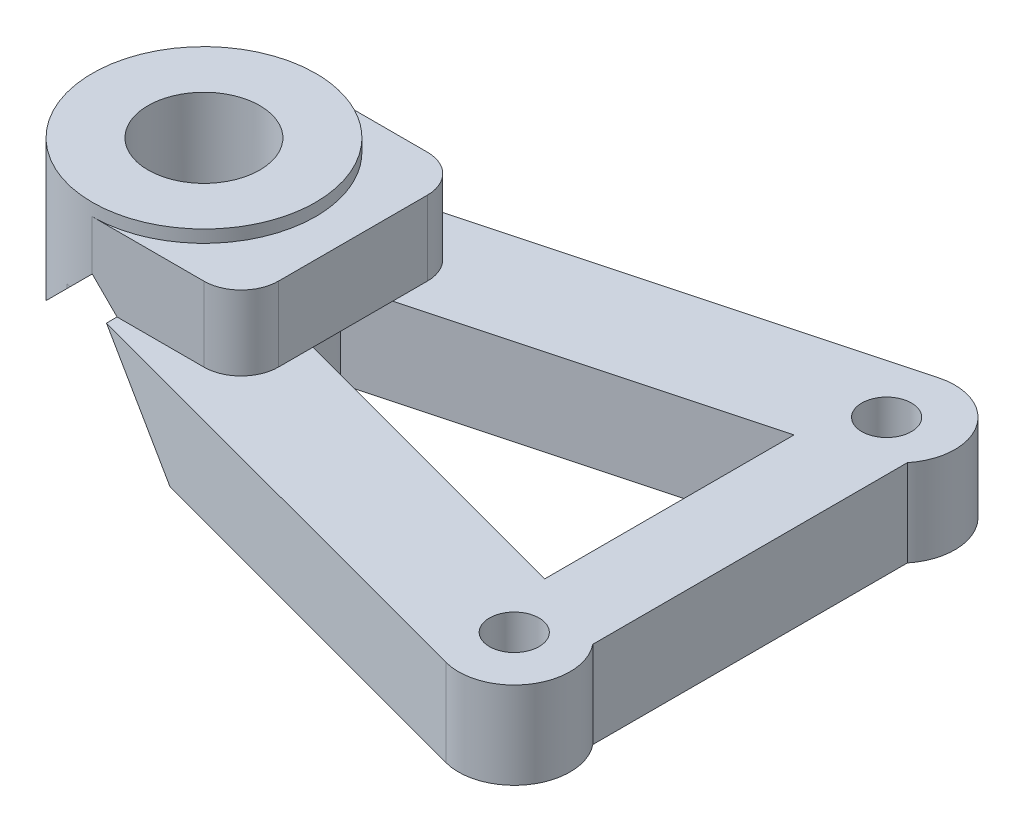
ISO-10303-21;
HEADER;
FILE_DESCRIPTION(('STEP AP214'),'2;1');
FILE_NAME('part.step','',(''),(''),'','','');
FILE_SCHEMA(('AUTOMOTIVE_DESIGN { 1 0 10303 214 1 1 1 1 }'));
ENDSEC;
DATA;
#1=APPLICATION_CONTEXT('core data for automotive mechanical design processes');
#2=APPLICATION_PROTOCOL_DEFINITION('international standard','automotive_design',2000,#1);
#3=PRODUCT_CONTEXT('',#1,'mechanical');
#4=PRODUCT('Part','Part','',(#3));
#5=PRODUCT_RELATED_PRODUCT_CATEGORY('part','',(#4));
#6=PRODUCT_DEFINITION_FORMATION('','',#4);
#7=PRODUCT_DEFINITION_CONTEXT('part definition',#1,'design');
#8=PRODUCT_DEFINITION('design','',#6,#7);
#9=PRODUCT_DEFINITION_SHAPE('','',#8);
#10=(LENGTH_UNIT() NAMED_UNIT(*) SI_UNIT(.MILLI.,.METRE.));
#11=(NAMED_UNIT(*) PLANE_ANGLE_UNIT() SI_UNIT($,.RADIAN.));
#12=(NAMED_UNIT(*) SI_UNIT($,.STERADIAN.) SOLID_ANGLE_UNIT());
#13=UNCERTAINTY_MEASURE_WITH_UNIT(LENGTH_MEASURE(1.E-05),#10,'distance_accuracy_value','');
#14=(GEOMETRIC_REPRESENTATION_CONTEXT(3) GLOBAL_UNCERTAINTY_ASSIGNED_CONTEXT((#13)) GLOBAL_UNIT_ASSIGNED_CONTEXT((#10,
#11,#12)) REPRESENTATION_CONTEXT('',''));
#15=CARTESIAN_POINT('',(0.,0.,0.));
#16=DIRECTION('',(0.,0.,1.));
#17=DIRECTION('',(1.,0.,0.));
#18=AXIS2_PLACEMENT_3D('',#15,#16,#17);
#19=CARTESIAN_POINT('',(0.,14.,0.));
#20=DIRECTION('',(0.,1.,0.));
#21=DIRECTION('',(0.,0.,1.));
#22=AXIS2_PLACEMENT_3D('',#19,#20,#21);
#23=PLANE('',#22);
#24=CARTESIAN_POINT('',(0.,14.,0.));
#25=DIRECTION('',(0.,1.,0.));
#26=DIRECTION('',(0.,0.,1.));
#27=AXIS2_PLACEMENT_3D('',#24,#25,#26);
#28=CIRCLE('',#27,4.5);
#29=CARTESIAN_POINT('',(0.,14.,-4.49999999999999));
#30=VERTEX_POINT('',#29);
#31=CARTESIAN_POINT('',(0.,14.,4.50000000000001));
#32=VERTEX_POINT('',#31);
#33=EDGE_CURVE('E215',#30,#32,#28,.F.);
#34=ORIENTED_EDGE('',*,*,#33,.T.);
#35=CARTESIAN_POINT('',(0.,14.,4.5));
#36=CARTESIAN_POINT('',(-0.858334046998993,14.,4.49989883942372));
#37=CARTESIAN_POINT('',(-1.65642619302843,14.,4.18404735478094));
#38=CARTESIAN_POINT('',(-2.08013280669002,14.,4.01636200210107));
#39=CARTESIAN_POINT('',(-2.46244389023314,14.,3.76647980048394));
#40=CARTESIAN_POINT('',(-2.85205745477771,14.,3.5118246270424));
#41=CARTESIAN_POINT('',(-3.18198051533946,14.,3.18198051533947));
#42=CARTESIAN_POINT('',(-3.5111460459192,14.,2.85289375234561));
#43=CARTESIAN_POINT('',(-3.76647980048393,14.,2.46244389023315));
#44=CARTESIAN_POINT('',(-4.01587843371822,14.,2.08106986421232));
#45=CARTESIAN_POINT('',(-4.18404735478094,14.,1.65642619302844));
#46=CARTESIAN_POINT('',(-4.49989877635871,14.,0.858869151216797));
#47=CARTESIAN_POINT('',(-4.5,14.,0.));
#48=CARTESIAN_POINT('',(-4.50010110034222,14.,-0.857822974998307));
#49=CARTESIAN_POINT('',(-4.18404735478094,14.,-1.65642619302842));
#50=CARTESIAN_POINT('',(-4.0163620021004,14.,-2.08013280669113));
#51=CARTESIAN_POINT('',(-3.76647980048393,14.,-2.46244389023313));
#52=CARTESIAN_POINT('',(-3.5118246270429,14.,-2.85205745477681));
#53=CARTESIAN_POINT('',(-3.18198051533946,14.,-3.18198051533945));
#54=CARTESIAN_POINT('',(-2.85289375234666,14.,-3.51114604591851));
#55=CARTESIAN_POINT('',(-2.46244389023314,14.,-3.76647980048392));
#56=CARTESIAN_POINT('',(-2.08106986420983,14.,-4.01587843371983));
#57=CARTESIAN_POINT('',(-1.65642619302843,14.,-4.18404735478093));
#58=CARTESIAN_POINT('',(-0.858869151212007,14.,-4.49989877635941));
#59=CARTESIAN_POINT('',(0.,14.,-4.5));
#60=B_SPLINE_CURVE_WITH_KNOTS('',2,(#35,#36,#37,#38,#39,#40,#41,#42,#43,#44,#45,#46,#47,#48,#49,
#50,#51,#52,#53,#54,#55,#56,#57,#58,#59),.UNSPECIFIED.,.F.,.F.,(3,2,2,2,2,2,2,2,2,2,2,2,3),(0.,
0.125,0.1875,0.25,0.3125,0.375,0.5,0.625,0.6875,0.75,0.8125,0.875,1.),.UNSPECIFIED.);
#61=EDGE_CURVE('E292',#32,#30,#60,.T.);
#62=ORIENTED_EDGE('',*,*,#61,.T.);
#63=EDGE_LOOP('',(#34,#62));
#64=FACE_BOUND('',#63,.T.);
#65=CARTESIAN_POINT('',(0.,14.,0.));
#66=DIRECTION('',(0.,1.,0.));
#67=DIRECTION('',(0.,0.,1.));
#68=AXIS2_PLACEMENT_3D('',#65,#66,#67);
#69=CIRCLE('',#68,9.);
#70=CARTESIAN_POINT('',(0.,14.,9.));
#71=VERTEX_POINT('',#70);
#72=CARTESIAN_POINT('',(0.,14.,-9.));
#73=VERTEX_POINT('',#72);
#74=EDGE_CURVE('E210',#71,#73,#69,.F.);
#75=ORIENTED_EDGE('',*,*,#74,.F.);
#76=CARTESIAN_POINT('',(0.,14.,9.));
#77=CARTESIAN_POINT('',(0.82572262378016,14.,8.99995134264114));
#78=CARTESIAN_POINT('',(1.6376674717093,14.,8.84974831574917));
#79=CARTESIAN_POINT('',(2.4981863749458,14.,8.69055949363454));
#80=CARTESIAN_POINT('',(3.31285238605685,14.,8.36809470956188));
#81=CARTESIAN_POINT('',(4.16073418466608,14.,8.03248230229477));
#82=CARTESIAN_POINT('',(4.92488778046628,14.,7.53295960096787));
#83=CARTESIAN_POINT('',(5.70453311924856,14.,7.02331003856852));
#84=CARTESIAN_POINT('',(6.36396103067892,14.,6.36396103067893));
#85=CARTESIAN_POINT('',(7.0226314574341,14.,5.70536941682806));
#86=CARTESIAN_POINT('',(7.53295960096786,14.,4.92488778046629));
#87=CARTESIAN_POINT('',(8.03199873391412,14.,4.16167124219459));
#88=CARTESIAN_POINT('',(8.36809470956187,14.,3.31285238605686));
#89=CARTESIAN_POINT('',(8.69026813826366,14.,2.4991952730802));
#90=CARTESIAN_POINT('',(8.84974831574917,14.,1.63766747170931));
#91=CARTESIAN_POINT('',(8.99995131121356,14.,0.826255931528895));
#92=CARTESIAN_POINT('',(9.,14.,0.));
#93=B_SPLINE_CURVE_WITH_KNOTS('',2,(#76,#77,#78,#79,#80,#81,#82,#83,#84,#85,#86,#87,#88,#89,#90,
#91,#92),.UNSPECIFIED.,.F.,.F.,(3,2,2,2,2,2,2,2,3),(0.,0.125,0.25,0.375,0.5,0.625,0.75,0.875,
1.),.UNSPECIFIED.);
#94=CARTESIAN_POINT('',(9.,14.,0.));
#95=VERTEX_POINT('',#94);
#96=EDGE_CURVE('E288',#71,#95,#93,.T.);
#97=ORIENTED_EDGE('',*,*,#96,.T.);
#98=CARTESIAN_POINT('',(9.,14.,0.));
#99=CARTESIAN_POINT('',(8.99995134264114,14.,-0.825722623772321));
#100=CARTESIAN_POINT('',(8.84974831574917,14.,-1.63766747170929));
#101=CARTESIAN_POINT('',(8.69055949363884,14.,-2.49818637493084));
#102=CARTESIAN_POINT('',(8.36809470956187,14.,-3.31285238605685));
#103=CARTESIAN_POINT('',(8.03248230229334,14.,-4.16073418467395));
#104=CARTESIAN_POINT('',(7.53295960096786,14.,-4.92488778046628));
#105=CARTESIAN_POINT('',(7.0233100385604,14.,-5.70453311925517));
#106=CARTESIAN_POINT('',(6.36396103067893,14.,-6.36396103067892));
#107=CARTESIAN_POINT('',(5.70536941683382,14.,-7.02263145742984));
#108=CARTESIAN_POINT('',(4.92488778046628,14.,-7.53295960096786));
#109=CARTESIAN_POINT('',(4.16167124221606,14.,-8.03199873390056));
#110=CARTESIAN_POINT('',(3.31285238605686,14.,-8.36809470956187));
#111=CARTESIAN_POINT('',(2.49919527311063,14.,-8.69026813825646));
#112=CARTESIAN_POINT('',(1.6376674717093,14.,-8.84974831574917));
#113=CARTESIAN_POINT('',(0.826255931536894,14.,-8.99995131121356));
#114=CARTESIAN_POINT('',(0.,14.,-9.));
#115=B_SPLINE_CURVE_WITH_KNOTS('',2,(#98,#99,#100,#101,#102,#103,#104,#105,#106,#107,#108,#109,
#110,#111,#112,#113,#114),.UNSPECIFIED.,.F.,.F.,(3,2,2,2,2,2,2,2,3),(0.,0.125,0.25,0.375,0.5,
0.625,0.75,0.875,1.),.UNSPECIFIED.);
#116=EDGE_CURVE('E289',#95,#73,#115,.T.);
#117=ORIENTED_EDGE('',*,*,#116,.T.);
#118=EDGE_LOOP('',(#75,#97,#117));
#119=FACE_BOUND('',#118,.T.);
#120=ADVANCED_FACE('F16',(#64,#119),#23,.T.);
#121=CARTESIAN_POINT('',(-2.327291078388,0.,8.693889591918));
#122=DIRECTION('',(-0.258587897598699,0.,0.965987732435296));
#123=DIRECTION('',(0.965987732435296,0.,0.258587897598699));
#124=AXIS2_PLACEMENT_3D('',#121,#122,#123);
#125=PLANE('',#124);
#126=CARTESIAN_POINT('',(-2.32729107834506,6.99999900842,8.69388959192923));
#127=CARTESIAN_POINT('',(-2.31367984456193,6.99999542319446,8.69753322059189));
#128=CARTESIAN_POINT('',(-2.30006005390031,6.99999183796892,8.70114488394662));
#129=CARTESIAN_POINT('',(-2.27280365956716,6.99998466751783,8.70830420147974));
#130=CARTESIAN_POINT('',(-2.25916705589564,6.99998108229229,8.71185185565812));
#131=CARTESIAN_POINT('',(-2.23187733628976,6.99997391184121,8.71888307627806));
#132=CARTESIAN_POINT('',(-2.21822422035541,6.99997032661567,8.72236664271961));
#133=CARTESIAN_POINT('',(-2.19090177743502,6.99996315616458,8.72926961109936));
#134=CARTESIAN_POINT('',(-2.17723245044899,6.99995957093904,8.73268901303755));
#135=CARTESIAN_POINT('',(-2.14987788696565,6.99995240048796,8.73946357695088));
#136=CARTESIAN_POINT('',(-2.13619265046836,6.99994881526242,8.742818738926));
#137=CARTESIAN_POINT('',(-2.10880656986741,6.99994164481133,8.74946474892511));
#138=CARTESIAN_POINT('',(-2.09510572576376,6.99993805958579,8.7527555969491));
#139=CARTESIAN_POINT('',(-2.06768873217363,6.99993088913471,8.7592729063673));
#140=CARTESIAN_POINT('',(-2.05397258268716,6.99992730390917,8.76249936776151));
#141=CARTESIAN_POINT('',(-2.02652528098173,6.99992013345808,8.76888783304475));
#142=CARTESIAN_POINT('',(-2.01279412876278,6.99991654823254,8.77204983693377));
#143=CARTESIAN_POINT('',(-1.99905562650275,6.999912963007,8.77517957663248));
#144=B_SPLINE_CURVE_WITH_KNOTS('',3,(#126,#127,#128,#129,#130,#131,#132,#133,#134,#135,#136,
#137,#138,#139,#140,#141,#142,#143),.UNSPECIFIED.,.F.,.F.,(4,2,2,2,2,2,2,2,4),(0.,
0.0422714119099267,0.0845428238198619,0.126814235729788,0.169085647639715,0.21135705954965,
0.253628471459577,0.295899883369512,0.338171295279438),.UNSPECIFIED.);
#145=CARTESIAN_POINT('',(-2.32729107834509,6.99999900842,8.69388959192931));
#146=VERTEX_POINT('',#145);
#147=CARTESIAN_POINT('',(-1.99982898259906,6.99994175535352,8.77811096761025));
#148=VERTEX_POINT('',#147);
#149=EDGE_CURVE('E238',#146,#148,#144,.T.);
#150=ORIENTED_EDGE('',*,*,#149,.F.);
#151=DIRECTION('',(0.,1.,0.));
#152=VECTOR('',#151,1.);
#153=CARTESIAN_POINT('',(-2.32729107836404,0.,8.69388959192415));
#154=LINE('',#153,#152);
#155=CARTESIAN_POINT('',(-2.32729107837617,6.67270892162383,8.69388959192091));
#156=VERTEX_POINT('',#155);
#157=EDGE_CURVE('E347',#156,#146,#154,.T.);
#158=ORIENTED_EDGE('',*,*,#157,.F.);
#159=DIRECTION('',(0.694769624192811,0.694769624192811,0.185984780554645));
#160=VECTOR('',#159,1.);
#161=CARTESIAN_POINT('',(-4.30519553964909,4.69480446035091,8.16441893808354));
#162=LINE('',#161,#160);
#163=EDGE_CURVE('E676',#156,#148,#162,.T.);
#164=ORIENTED_EDGE('',*,*,#163,.T.);
#165=EDGE_LOOP('',(#150,#158,#164));
#166=FACE_BOUND('',#165,.T.);
#167=ADVANCED_FACE('F308',(#166),#125,.T.);
#168=CARTESIAN_POINT('',(39.33635446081,0.,-19.84694479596));
#169=DIRECTION('',(-0.258587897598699,0.,-0.965987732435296));
#170=DIRECTION('',(-0.965987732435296,0.,0.258587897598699));
#171=AXIS2_PLACEMENT_3D('',#168,#169,#170);
#172=PLANE('',#171);
#173=DIRECTION('',(0.,1.,0.));
#174=VECTOR('',#173,1.);
#175=CARTESIAN_POINT('',(-2.32729107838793,0.,-8.69388959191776));
#176=LINE('',#175,#174);
#177=CARTESIAN_POINT('',(-2.32729107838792,6.999999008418,-8.69388959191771));
#178=VERTEX_POINT('',#177);
#179=CARTESIAN_POINT('',(-2.3272910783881,6.67270892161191,-8.69388959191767));
#180=VERTEX_POINT('',#179);
#181=EDGE_CURVE('E354',#178,#180,#176,.F.);
#182=ORIENTED_EDGE('',*,*,#181,.F.);
#183=CARTESIAN_POINT('',(-1.99905562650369,6.999912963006,-8.77517957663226));
#184=CARTESIAN_POINT('',(-2.01279412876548,6.9999165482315,-8.77204983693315));
#185=CARTESIAN_POINT('',(-2.0265252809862,6.999920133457,-8.76888783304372));
#186=CARTESIAN_POINT('',(-2.05397258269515,6.999927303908,-8.76249936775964));
#187=CARTESIAN_POINT('',(-2.06768873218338,6.9999308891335,-8.759272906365));
#188=CARTESIAN_POINT('',(-2.09510572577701,6.9999380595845,-8.75275559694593));
#189=CARTESIAN_POINT('',(-2.10880656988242,6.99994164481,-8.7494647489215));
#190=CARTESIAN_POINT('',(-2.13619265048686,6.999948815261,-8.74281873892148));
#191=CARTESIAN_POINT('',(-2.14987788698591,6.9999524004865,-8.7394635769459));
#192=CARTESIAN_POINT('',(-2.17723245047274,6.9999595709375,-8.73268901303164));
#193=CARTESIAN_POINT('',(-2.19090177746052,6.999963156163,-8.72926961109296));
#194=CARTESIAN_POINT('',(-2.2182242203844,6.999970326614,-8.72236664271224));
#195=CARTESIAN_POINT('',(-2.23187733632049,6.9999739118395,-8.7188830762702));
#196=CARTESIAN_POINT('',(-2.25916705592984,6.9999810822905,-8.71185185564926));
#197=CARTESIAN_POINT('',(-2.2728036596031,6.999984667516,-8.70830420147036));
#198=CARTESIAN_POINT('',(-2.30006005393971,6.999991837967,-8.70114488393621));
#199=CARTESIAN_POINT('',(-2.31367984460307,6.9999954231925,-8.69753322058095));
#200=CARTESIAN_POINT('',(-2.32729107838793,6.999999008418,-8.69388959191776));
#201=B_SPLINE_CURVE_WITH_KNOTS('',3,(#183,#184,#185,#186,#187,#188,#189,#190,#191,#192,#193,
#194,#195,#196,#197,#198,#199,#200),.UNSPECIFIED.,.F.,.F.,(4,2,2,2,2,2,2,2,4),(0.,
0.0422714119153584,0.0845428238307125,0.126814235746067,0.169085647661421,0.21135705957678,
0.253628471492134,0.295899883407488,0.338171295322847),.UNSPECIFIED.);
#202=CARTESIAN_POINT('',(-1.99982898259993,6.99994175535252,-8.77811096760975));
#203=VERTEX_POINT('',#202);
#204=EDGE_CURVE('E358',#203,#178,#201,.T.);
#205=ORIENTED_EDGE('',*,*,#204,.F.);
#206=DIRECTION('',(-0.694769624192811,-0.694769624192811,0.185984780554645));
#207=VECTOR('',#206,1.);
#208=CARTESIAN_POINT('',(1.89740267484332,10.8974026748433,-9.8248094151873));
#209=LINE('',#208,#207);
#210=EDGE_CURVE('E536',#203,#180,#209,.T.);
#211=ORIENTED_EDGE('',*,*,#210,.T.);
#212=EDGE_LOOP('',(#182,#205,#211));
#213=FACE_BOUND('',#212,.T.);
#214=ADVANCED_FACE('F689',(#213),#172,.T.);
#215=CARTESIAN_POINT('',(0.,13.,0.));
#216=DIRECTION('',(0.,1.,0.));
#217=DIRECTION('',(0.,0.,1.));
#218=AXIS2_PLACEMENT_3D('',#215,#216,#217);
#219=PLANE('',#218);
#220=CARTESIAN_POINT('',(8.999999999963,13.,-2.577048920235E-05));
#221=CARTESIAN_POINT('',(8.99995295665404,13.,0.877704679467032));
#222=CARTESIAN_POINT('',(8.83041086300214,13.,1.73892035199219));
#223=CARTESIAN_POINT('',(8.65761673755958,13.,2.61665523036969));
#224=CARTESIAN_POINT('',(8.31492318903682,13.,3.44413303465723));
#225=CARTESIAN_POINT('',(7.97263187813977,13.,4.27063958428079));
#226=CARTESIAN_POINT('',(7.47366731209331,13.,5.01440892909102));
#227=CARTESIAN_POINT('',(6.98495672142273,13.,5.74289343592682));
#228=CARTESIAN_POINT('',(6.36397014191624,13.,6.36395191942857));
#229=CARTESIAN_POINT('',(5.74371279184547,13.,6.98428108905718));
#230=CARTESIAN_POINT('',(5.01443032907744,13.,7.47365295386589));
#231=CARTESIAN_POINT('',(4.27159343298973,13.,7.97212027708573));
#232=CARTESIAN_POINT('',(3.4441568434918,13.,8.31491332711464));
#233=CARTESIAN_POINT('',(2.61769146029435,13.,8.65730402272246));
#234=CARTESIAN_POINT('',(1.73894563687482,13.,8.83040588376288));
#235=CARTESIAN_POINT('',(0.87825848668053,13.,8.9999504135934));
#236=CARTESIAN_POINT('',(0.,13.,9.));
#237=B_SPLINE_CURVE_WITH_KNOTS('',2,(#220,#221,#222,#223,#224,#225,#226,#227,#228,#229,#230,
#231,#232,#233,#234,#235,#236),.UNSPECIFIED.,.F.,.F.,(3,2,2,2,2,2,2,2,3),(0.,0.125,0.25,0.375,
0.5,0.625,0.75,0.875,1.),.UNSPECIFIED.);
#238=CARTESIAN_POINT('',(8.99999999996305,13.,-2.57704892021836E-05));
#239=VERTEX_POINT('',#238);
#240=CARTESIAN_POINT('',(0.,13.,9.));
#241=VERTEX_POINT('',#240);
#242=EDGE_CURVE('E343',#239,#241,#237,.T.);
#243=ORIENTED_EDGE('',*,*,#242,.T.);
#244=DIRECTION('',(1.,0.,0.));
#245=VECTOR('',#244,1.);
#246=CARTESIAN_POINT('',(0.,13.,9.));
#247=LINE('',#246,#245);
#248=CARTESIAN_POINT('',(9.,13.,9.));
#249=VERTEX_POINT('',#248);
#250=EDGE_CURVE('E223',#249,#241,#247,.F.);
#251=ORIENTED_EDGE('',*,*,#250,.F.);
#252=CARTESIAN_POINT('',(9.,13.,6.));
#253=DIRECTION('',(0.,-1.,0.));
#254=DIRECTION('',(0.,0.,-1.));
#255=AXIS2_PLACEMENT_3D('',#252,#253,#254);
#256=CIRCLE('',#255,3.);
#257=CARTESIAN_POINT('',(12.,13.,6.));
#258=VERTEX_POINT('',#257);
#259=EDGE_CURVE('E505',#258,#249,#256,.T.);
#260=ORIENTED_EDGE('',*,*,#259,.F.);
#261=DIRECTION('',(0.,0.,-1.));
#262=VECTOR('',#261,1.);
#263=CARTESIAN_POINT('',(12.,13.,9.));
#264=LINE('',#263,#262);
#265=CARTESIAN_POINT('',(12.,13.,-6.));
#266=VERTEX_POINT('',#265);
#267=EDGE_CURVE('E205',#266,#258,#264,.F.);
#268=ORIENTED_EDGE('',*,*,#267,.F.);
#269=CARTESIAN_POINT('',(9.,13.,-6.));
#270=DIRECTION('',(0.,-1.,0.));
#271=DIRECTION('',(0.,0.,-1.));
#272=AXIS2_PLACEMENT_3D('',#269,#270,#271);
#273=CIRCLE('',#272,3.);
#274=CARTESIAN_POINT('',(9.,13.,-9.));
#275=VERTEX_POINT('',#274);
#276=EDGE_CURVE('E202',#275,#266,#273,.T.);
#277=ORIENTED_EDGE('',*,*,#276,.F.);
#278=DIRECTION('',(-1.,0.,0.));
#279=VECTOR('',#278,1.);
#280=CARTESIAN_POINT('',(12.,13.,-9.));
#281=LINE('',#280,#279);
#282=CARTESIAN_POINT('',(6.97468188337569E-05,13.,-8.9999999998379));
#283=VERTEX_POINT('',#282);
#284=EDGE_CURVE('E188',#283,#275,#281,.F.);
#285=ORIENTED_EDGE('',*,*,#284,.F.);
#286=CARTESIAN_POINT('',(6.974681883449E-05,13.,-8.99999999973));
#287=CARTESIAN_POINT('',(0.825787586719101,13.,-8.99994494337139));
#288=CARTESIAN_POINT('',(1.63772672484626,13.,-8.84973735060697));
#289=CARTESIAN_POINT('',(2.4982388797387,13.,-8.6905438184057));
#290=CARTESIAN_POINT('',(3.31289777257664,13.,-8.36807674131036));
#291=CARTESIAN_POINT('',(4.16077165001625,13.,-8.03246215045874));
#292=CARTESIAN_POINT('',(4.92491776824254,13.,-7.5329399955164));
#293=CARTESIAN_POINT('',(5.70455522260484,13.,-7.02329115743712));
#294=CARTESIAN_POINT('',(6.36397657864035,13.,-6.36394548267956));
#295=CARTESIAN_POINT('',(7.02264044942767,13.,-5.70535720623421));
#296=CARTESIAN_POINT('',(7.53296405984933,13.,-4.9248809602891));
#297=CARTESIAN_POINT('',(8.03199891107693,13.,-4.16166946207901));
#298=CARTESIAN_POINT('',(8.36809292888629,13.,-3.3128568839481));
#299=CARTESIAN_POINT('',(8.69026466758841,13.,-2.49920531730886));
#300=CARTESIAN_POINT('',(8.84974535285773,13.,-1.63768348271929));
#301=CARTESIAN_POINT('',(8.99994894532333,13.,-0.826276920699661));
#302=CARTESIAN_POINT('',(8.999999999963,13.,-2.577048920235E-05));
#303=B_SPLINE_CURVE_WITH_KNOTS('',2,(#286,#287,#288,#289,#290,#291,#292,#293,#294,#295,#296,
#297,#298,#299,#300,#301,#302),.UNSPECIFIED.,.F.,.F.,(3,2,2,2,2,2,2,2,3),(0.,0.125,0.25,0.375,
0.5,0.625,0.75,0.875,1.),.UNSPECIFIED.);
#304=EDGE_CURVE('E293',#283,#239,#303,.T.);
#305=ORIENTED_EDGE('',*,*,#304,.T.);
#306=EDGE_LOOP('',(#243,#251,#260,#268,#277,#285,#305));
#307=FACE_BOUND('',#306,.T.);
#308=ADVANCED_FACE('F203',(#307),#219,.T.);
#309=CARTESIAN_POINT('',(0.,0.,0.));
#310=DIRECTION('',(0.,1.,0.));
#311=DIRECTION('',(0.,0.,1.));
#312=AXIS2_PLACEMENT_3D('',#309,#310,#311);
#313=CYLINDRICAL_SURFACE('',#312,9.);
#314=ORIENTED_EDGE('',*,*,#74,.T.);
#315=ORIENTED_EDGE('',*,*,#116,.F.);
#316=ORIENTED_EDGE('',*,*,#96,.F.);
#317=EDGE_LOOP('',(#314,#315,#316));
#318=FACE_BOUND('',#317,.T.);
#319=ORIENTED_EDGE('',*,*,#304,.F.);
#320=DIRECTION('',(1.74367047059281E-05,0.999999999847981,0.));
#321=VECTOR('',#320,1.);
#322=CARTESIAN_POINT('',(0.,9.,-9.));
#323=LINE('',#322,#321);
#324=CARTESIAN_POINT('',(0.,9.,-8.99999999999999));
#325=VERTEX_POINT('',#324);
#326=EDGE_CURVE('E196',#325,#283,#323,.T.);
#327=ORIENTED_EDGE('',*,*,#326,.F.);
#328=CARTESIAN_POINT('',(0.,9.,0.));
#329=DIRECTION('',(-0.707106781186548,0.707106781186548,0.));
#330=DIRECTION('',(0.707106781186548,0.707106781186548,0.));
#331=AXIS2_PLACEMENT_3D('',#328,#329,#330);
#332=ELLIPSE('',#331,12.7279220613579,9.);
#333=EDGE_CURVE('E665',#325,#203,#332,.T.);
#334=ORIENTED_EDGE('',*,*,#333,.T.);
#335=ORIENTED_EDGE('',*,*,#204,.T.);
#336=ORIENTED_EDGE('',*,*,#181,.T.);
#337=CARTESIAN_POINT('',(0.,9.,0.));
#338=DIRECTION('',(-0.707106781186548,0.707106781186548,0.));
#339=DIRECTION('',(0.707106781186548,0.707106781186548,0.));
#340=AXIS2_PLACEMENT_3D('',#337,#338,#339);
#341=ELLIPSE('',#340,12.7279220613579,9.);
#342=EDGE_CURVE('E218',#180,#156,#341,.T.);
#343=ORIENTED_EDGE('',*,*,#342,.T.);
#344=ORIENTED_EDGE('',*,*,#157,.T.);
#345=ORIENTED_EDGE('',*,*,#149,.T.);
#346=CARTESIAN_POINT('',(0.,9.,0.));
#347=DIRECTION('',(-0.707106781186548,0.707106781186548,0.));
#348=DIRECTION('',(0.707106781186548,0.707106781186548,0.));
#349=AXIS2_PLACEMENT_3D('',#346,#347,#348);
#350=ELLIPSE('',#349,12.7279220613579,9.);
#351=CARTESIAN_POINT('',(0.,9.,9.00000000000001));
#352=VERTEX_POINT('',#351);
#353=EDGE_CURVE('E674',#148,#352,#350,.T.);
#354=ORIENTED_EDGE('',*,*,#353,.T.);
#355=DIRECTION('',(0.,1.,0.));
#356=VECTOR('',#355,1.);
#357=CARTESIAN_POINT('',(0.,7.,9.));
#358=LINE('',#357,#356);
#359=EDGE_CURVE('E226',#241,#352,#358,.F.);
#360=ORIENTED_EDGE('',*,*,#359,.F.);
#361=ORIENTED_EDGE('',*,*,#242,.F.);
#362=EDGE_LOOP('',(#319,#327,#334,#335,#336,#343,#344,#345,#354,#360,#361));
#363=FACE_BOUND('',#362,.T.);
#364=ADVANCED_FACE('F244',(#318,#363),#313,.T.);
#365=CARTESIAN_POINT('',(9.,32.2504,-6.));
#366=DIRECTION('',(0.,-1.,0.));
#367=DIRECTION('',(0.,0.,-1.));
#368=AXIS2_PLACEMENT_3D('',#365,#366,#367);
#369=CYLINDRICAL_SURFACE('',#368,3.);
#370=DIRECTION('',(0.,1.,0.));
#371=VECTOR('',#370,1.);
#372=CARTESIAN_POINT('',(9.,7.,-9.));
#373=LINE('',#372,#371);
#374=CARTESIAN_POINT('',(9.,7.,-9.));
#375=VERTEX_POINT('',#374);
#376=EDGE_CURVE('E192',#275,#375,#373,.F.);
#377=ORIENTED_EDGE('',*,*,#376,.F.);
#378=ORIENTED_EDGE('',*,*,#276,.T.);
#379=DIRECTION('',(0.,1.,0.));
#380=VECTOR('',#379,1.);
#381=CARTESIAN_POINT('',(12.,7.,-6.));
#382=LINE('',#381,#380);
#383=CARTESIAN_POINT('',(12.,7.,-6.));
#384=VERTEX_POINT('',#383);
#385=EDGE_CURVE('E209',#384,#266,#382,.T.);
#386=ORIENTED_EDGE('',*,*,#385,.F.);
#387=CARTESIAN_POINT('',(9.,7.,-6.));
#388=DIRECTION('',(0.,-1.,0.));
#389=DIRECTION('',(0.,0.,-1.));
#390=AXIS2_PLACEMENT_3D('',#387,#388,#389);
#391=CIRCLE('',#390,3.);
#392=EDGE_CURVE('E214',#375,#384,#391,.T.);
#393=ORIENTED_EDGE('',*,*,#392,.F.);
#394=EDGE_LOOP('',(#377,#378,#386,#393));
#395=FACE_BOUND('',#394,.T.);
#396=ADVANCED_FACE('F213',(#395),#369,.T.);
#397=CARTESIAN_POINT('',(12.,7.,9.));
#398=DIRECTION('',(1.,0.,0.));
#399=DIRECTION('',(0.,0.,-1.));
#400=AXIS2_PLACEMENT_3D('',#397,#398,#399);
#401=PLANE('',#400);
#402=ORIENTED_EDGE('',*,*,#385,.T.);
#403=ORIENTED_EDGE('',*,*,#267,.T.);
#404=DIRECTION('',(0.,-1.,0.));
#405=VECTOR('',#404,1.);
#406=CARTESIAN_POINT('',(12.,32.2504,6.));
#407=LINE('',#406,#405);
#408=CARTESIAN_POINT('',(12.,7.,6.));
#409=VERTEX_POINT('',#408);
#410=EDGE_CURVE('E233',#409,#258,#407,.F.);
#411=ORIENTED_EDGE('',*,*,#410,.F.);
#412=DIRECTION('',(0.,0.,1.));
#413=VECTOR('',#412,1.);
#414=CARTESIAN_POINT('',(12.,7.,0.));
#415=LINE('',#414,#413);
#416=CARTESIAN_POINT('',(12.0000000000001,7.,3.21231281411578));
#417=VERTEX_POINT('',#416);
#418=EDGE_CURVE('E367',#417,#409,#415,.T.);
#419=ORIENTED_EDGE('',*,*,#418,.F.);
#420=DIRECTION('',(0.,0.,1.));
#421=VECTOR('',#420,1.);
#422=CARTESIAN_POINT('',(12.,7.,0.));
#423=LINE('',#422,#421);
#424=CARTESIAN_POINT('',(12.,7.,-3.21231281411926));
#425=VERTEX_POINT('',#424);
#426=EDGE_CURVE('E481',#417,#425,#423,.F.);
#427=ORIENTED_EDGE('',*,*,#426,.T.);
#428=DIRECTION('',(0.,0.,1.));
#429=VECTOR('',#428,1.);
#430=CARTESIAN_POINT('',(12.,7.,0.));
#431=LINE('',#430,#429);
#432=EDGE_CURVE('E369',#384,#425,#431,.T.);
#433=ORIENTED_EDGE('',*,*,#432,.F.);
#434=EDGE_LOOP('',(#402,#403,#411,#419,#427,#433));
#435=FACE_BOUND('',#434,.T.);
#436=ADVANCED_FACE('F733',(#435),#401,.T.);
#437=CARTESIAN_POINT('',(9.,32.2504,6.));
#438=DIRECTION('',(0.,-1.,0.));
#439=DIRECTION('',(0.,0.,-1.));
#440=AXIS2_PLACEMENT_3D('',#437,#438,#439);
#441=CYLINDRICAL_SURFACE('',#440,3.);
#442=ORIENTED_EDGE('',*,*,#410,.T.);
#443=ORIENTED_EDGE('',*,*,#259,.T.);
#444=DIRECTION('',(0.,1.,0.));
#445=VECTOR('',#444,1.);
#446=CARTESIAN_POINT('',(9.,7.,9.));
#447=LINE('',#446,#445);
#448=CARTESIAN_POINT('',(9.,7.,9.));
#449=VERTEX_POINT('',#448);
#450=EDGE_CURVE('E227',#449,#249,#447,.T.);
#451=ORIENTED_EDGE('',*,*,#450,.F.);
#452=CARTESIAN_POINT('',(9.,7.,6.));
#453=DIRECTION('',(0.,-1.,0.));
#454=DIRECTION('',(0.,0.,-1.));
#455=AXIS2_PLACEMENT_3D('',#452,#453,#454);
#456=CIRCLE('',#455,3.);
#457=EDGE_CURVE('E364',#409,#449,#456,.T.);
#458=ORIENTED_EDGE('',*,*,#457,.F.);
#459=EDGE_LOOP('',(#442,#443,#451,#458));
#460=FACE_BOUND('',#459,.T.);
#461=ADVANCED_FACE('F739',(#460),#441,.T.);
#462=CARTESIAN_POINT('',(12.,7.,-9.));
#463=DIRECTION('',(0.,0.,-1.));
#464=DIRECTION('',(-1.,0.,0.));
#465=AXIS2_PLACEMENT_3D('',#462,#463,#464);
#466=PLANE('',#465);
#467=ORIENTED_EDGE('',*,*,#376,.T.);
#468=DIRECTION('',(1.,0.,0.));
#469=VECTOR('',#468,1.);
#470=CARTESIAN_POINT('',(0.,7.,-9.));
#471=LINE('',#470,#469);
#472=CARTESIAN_POINT('',(2.,7.,-8.99999999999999));
#473=VERTEX_POINT('',#472);
#474=EDGE_CURVE('E375',#473,#375,#471,.T.);
#475=ORIENTED_EDGE('',*,*,#474,.F.);
#476=DIRECTION('',(-0.707106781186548,0.707106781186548,0.));
#477=VECTOR('',#476,1.);
#478=CARTESIAN_POINT('',(9.,0.,-8.99999999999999));
#479=LINE('',#478,#477);
#480=EDGE_CURVE('E388',#473,#325,#479,.T.);
#481=ORIENTED_EDGE('',*,*,#480,.T.);
#482=ORIENTED_EDGE('',*,*,#326,.T.);
#483=ORIENTED_EDGE('',*,*,#284,.T.);
#484=EDGE_LOOP('',(#467,#475,#481,#482,#483));
#485=FACE_BOUND('',#484,.T.);
#486=ADVANCED_FACE('F190',(#485),#466,.T.);
#487=CARTESIAN_POINT('',(0.,0.,0.));
#488=DIRECTION('',(0.,1.,0.));
#489=DIRECTION('',(0.,0.,1.));
#490=AXIS2_PLACEMENT_3D('',#487,#488,#489);
#491=CYLINDRICAL_SURFACE('',#490,4.5);
#492=ORIENTED_EDGE('',*,*,#33,.F.);
#493=ORIENTED_EDGE('',*,*,#61,.F.);
#494=EDGE_LOOP('',(#492,#493));
#495=FACE_BOUND('',#494,.T.);
#496=CARTESIAN_POINT('',(0.,9.,0.));
#497=DIRECTION('',(0.707106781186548,0.707106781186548,0.));
#498=DIRECTION('',(-0.707106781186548,0.707106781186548,0.));
#499=AXIS2_PLACEMENT_3D('',#496,#497,#498);
#500=ELLIPSE('',#499,6.36396103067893,4.5);
#501=CARTESIAN_POINT('',(0.,9.,-4.49999999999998));
#502=VERTEX_POINT('',#501);
#503=CARTESIAN_POINT('',(0.,9.,4.50000000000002));
#504=VERTEX_POINT('',#503);
#505=EDGE_CURVE('E384',#502,#504,#500,.F.);
#506=ORIENTED_EDGE('',*,*,#505,.T.);
#507=CARTESIAN_POINT('',(0.,9.,0.));
#508=DIRECTION('',(-0.707106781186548,0.707106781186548,0.));
#509=DIRECTION('',(0.707106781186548,0.707106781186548,0.));
#510=AXIS2_PLACEMENT_3D('',#507,#508,#509);
#511=ELLIPSE('',#510,6.36396103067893,4.5);
#512=EDGE_CURVE('E670',#504,#502,#511,.F.);
#513=ORIENTED_EDGE('',*,*,#512,.T.);
#514=EDGE_LOOP('',(#506,#513));
#515=FACE_BOUND('',#514,.T.);
#516=ADVANCED_FACE('F554',(#495,#515),#491,.F.);
#517=CARTESIAN_POINT('',(0.,9.,-24.00078380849));
#518=DIRECTION('',(-0.707106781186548,0.707106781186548,0.));
#519=DIRECTION('',(-0.707106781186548,-0.707106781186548,0.));
#520=AXIS2_PLACEMENT_3D('',#517,#518,#519);
#521=PLANE('',#520);
#522=ORIENTED_EDGE('',*,*,#333,.F.);
#523=DIRECTION('',(0.,0.,1.));
#524=VECTOR('',#523,1.);
#525=CARTESIAN_POINT('',(0.,9.,-24.00078380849));
#526=LINE('',#525,#524);
#527=EDGE_CURVE('E385',#325,#502,#526,.T.);
#528=ORIENTED_EDGE('',*,*,#527,.T.);
#529=ORIENTED_EDGE('',*,*,#512,.F.);
#530=DIRECTION('',(0.,0.,1.));
#531=VECTOR('',#530,1.);
#532=CARTESIAN_POINT('',(0.,9.,-24.00078380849));
#533=LINE('',#532,#531);
#534=EDGE_CURVE('E380',#504,#352,#533,.T.);
#535=ORIENTED_EDGE('',*,*,#534,.T.);
#536=ORIENTED_EDGE('',*,*,#353,.F.);
#537=ORIENTED_EDGE('',*,*,#163,.F.);
#538=ORIENTED_EDGE('',*,*,#342,.F.);
#539=ORIENTED_EDGE('',*,*,#210,.F.);
#540=EDGE_LOOP('',(#522,#528,#529,#535,#536,#537,#538,#539));
#541=FACE_BOUND('',#540,.T.);
#542=ADVANCED_FACE('F564',(#541),#521,.F.);
#543=CARTESIAN_POINT('',(0.,7.,9.));
#544=DIRECTION('',(0.,0.,1.));
#545=DIRECTION('',(1.,0.,0.));
#546=AXIS2_PLACEMENT_3D('',#543,#544,#545);
#547=PLANE('',#546);
#548=ORIENTED_EDGE('',*,*,#250,.T.);
#549=ORIENTED_EDGE('',*,*,#359,.T.);
#550=DIRECTION('',(-0.707106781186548,0.707106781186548,0.));
#551=VECTOR('',#550,1.);
#552=CARTESIAN_POINT('',(9.,0.,9.00000000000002));
#553=LINE('',#552,#551);
#554=CARTESIAN_POINT('',(2.,7.,9.00000000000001));
#555=VERTEX_POINT('',#554);
#556=EDGE_CURVE('E383',#352,#555,#553,.F.);
#557=ORIENTED_EDGE('',*,*,#556,.T.);
#558=DIRECTION('',(1.,0.,0.));
#559=VECTOR('',#558,1.);
#560=CARTESIAN_POINT('',(0.,7.,9.));
#561=LINE('',#560,#559);
#562=EDGE_CURVE('E361',#449,#555,#561,.F.);
#563=ORIENTED_EDGE('',*,*,#562,.F.);
#564=ORIENTED_EDGE('',*,*,#450,.T.);
#565=EDGE_LOOP('',(#548,#549,#557,#563,#564));
#566=FACE_BOUND('',#565,.T.);
#567=ADVANCED_FACE('F568',(#566),#547,.T.);
#568=CARTESIAN_POINT('',(0.,7.,0.));
#569=DIRECTION('',(0.,1.,0.));
#570=DIRECTION('',(0.,0.,1.));
#571=AXIS2_PLACEMENT_3D('',#568,#569,#570);
#572=PLANE('',#571);
#573=CARTESIAN_POINT('',(0.,7.,0.));
#574=DIRECTION('',(0.,1.,0.));
#575=DIRECTION('',(0.,0.,1.));
#576=AXIS2_PLACEMENT_3D('',#573,#574,#575);
#577=CIRCLE('',#576,9.);
#578=CARTESIAN_POINT('',(8.69388959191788,7.,-2.32729107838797));
#579=VERTEX_POINT('',#578);
#580=CARTESIAN_POINT('',(8.69388959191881,7.,2.32729107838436));
#581=VERTEX_POINT('',#580);
#582=EDGE_CURVE('E377',#579,#581,#577,.F.);
#583=ORIENTED_EDGE('',*,*,#582,.F.);
#584=DIRECTION('',(0.965987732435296,0.,-0.258587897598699));
#585=VECTOR('',#584,1.);
#586=CARTESIAN_POINT('',(8.693889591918,7.,-2.327291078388));
#587=LINE('',#586,#585);
#588=EDGE_CURVE('E477',#425,#579,#587,.F.);
#589=ORIENTED_EDGE('',*,*,#588,.F.);
#590=ORIENTED_EDGE('',*,*,#426,.F.);
#591=DIRECTION('',(-0.965987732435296,0.,-0.258587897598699));
#592=VECTOR('',#591,1.);
#593=CARTESIAN_POINT('',(37.5,7.,10.03847754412));
#594=LINE('',#593,#592);
#595=EDGE_CURVE('E518',#581,#417,#594,.F.);
#596=ORIENTED_EDGE('',*,*,#595,.F.);
#597=EDGE_LOOP('',(#583,#589,#590,#596));
#598=FACE_BOUND('',#597,.T.);
#599=ADVANCED_FACE('F572',(#598),#572,.F.);
#600=CARTESIAN_POINT('',(0.,0.,0.));
#601=DIRECTION('',(0.,1.,0.));
#602=DIRECTION('',(0.,0.,1.));
#603=AXIS2_PLACEMENT_3D('',#600,#601,#602);
#604=CYLINDRICAL_SURFACE('',#603,9.);
#605=ORIENTED_EDGE('',*,*,#582,.T.);
#606=DIRECTION('',(0.,1.,0.));
#607=VECTOR('',#606,1.);
#608=CARTESIAN_POINT('',(8.69388959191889,0.,2.32729107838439));
#609=LINE('',#608,#607);
#610=CARTESIAN_POINT('',(8.69388959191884,0.306110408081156,2.32729107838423));
#611=VERTEX_POINT('',#610);
#612=EDGE_CURVE('E491',#611,#581,#609,.T.);
#613=ORIENTED_EDGE('',*,*,#612,.F.);
#614=CARTESIAN_POINT('',(0.,9.,0.));
#615=DIRECTION('',(0.707106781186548,0.707106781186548,0.));
#616=DIRECTION('',(-0.707106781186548,0.707106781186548,0.));
#617=AXIS2_PLACEMENT_3D('',#614,#615,#616);
#618=ELLIPSE('',#617,12.7279220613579,9.);
#619=CARTESIAN_POINT('',(8.69388959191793,0.306110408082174,-2.32729107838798));
#620=VERTEX_POINT('',#619);
#621=EDGE_CURVE('E392',#611,#620,#618,.T.);
#622=ORIENTED_EDGE('',*,*,#621,.T.);
#623=DIRECTION('',(0.,1.,0.));
#624=VECTOR('',#623,1.);
#625=CARTESIAN_POINT('',(8.693889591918,0.,-2.327291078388));
#626=LINE('',#625,#624);
#627=EDGE_CURVE('E474',#579,#620,#626,.F.);
#628=ORIENTED_EDGE('',*,*,#627,.F.);
#629=EDGE_LOOP('',(#605,#613,#622,#628));
#630=FACE_BOUND('',#629,.T.);
#631=ADVANCED_FACE('F576',(#630),#604,.T.);
#632=CARTESIAN_POINT('',(0.,7.,0.));
#633=DIRECTION('',(0.,1.,0.));
#634=DIRECTION('',(0.,0.,1.));
#635=AXIS2_PLACEMENT_3D('',#632,#633,#634);
#636=PLANE('',#635);
#637=CARTESIAN_POINT('',(40.,7.,-15.));
#638=DIRECTION('',(0.,1.,0.));
#639=DIRECTION('',(0.,0.,1.));
#640=AXIS2_PLACEMENT_3D('',#637,#638,#639);
#641=CIRCLE('',#640,2.);
#642=CARTESIAN_POINT('',(40.,7.,-13.));
#643=VERTEX_POINT('',#642);
#644=EDGE_CURVE('E459',#643,#643,#641,.F.);
#645=ORIENTED_EDGE('',*,*,#644,.T.);
#646=EDGE_LOOP('',(#645));
#647=FACE_BOUND('',#646,.T.);
#648=CARTESIAN_POINT('',(40.,7.,15.));
#649=DIRECTION('',(0.,1.,0.));
#650=DIRECTION('',(0.,0.,1.));
#651=AXIS2_PLACEMENT_3D('',#648,#649,#650);
#652=CIRCLE('',#651,2.);
#653=CARTESIAN_POINT('',(40.,7.,17.));
#654=VERTEX_POINT('',#653);
#655=EDGE_CURVE('E476',#654,#654,#652,.F.);
#656=ORIENTED_EDGE('',*,*,#655,.T.);
#657=EDGE_LOOP('',(#656));
#658=FACE_BOUND('',#657,.T.);
#659=ORIENTED_EDGE('',*,*,#457,.T.);
#660=ORIENTED_EDGE('',*,*,#562,.T.);
#661=DIRECTION('',(0.,0.,1.));
#662=VECTOR('',#661,1.);
#663=CARTESIAN_POINT('',(2.,7.,-24.00078380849));
#664=LINE('',#663,#662);
#665=CARTESIAN_POINT('',(1.99999999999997,7.,9.85227397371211));
#666=VERTEX_POINT('',#665);
#667=EDGE_CURVE('E416',#555,#666,#664,.T.);
#668=ORIENTED_EDGE('',*,*,#667,.T.);
#669=DIRECTION('',(0.965987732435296,0.,0.258587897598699));
#670=VECTOR('',#669,1.);
#671=CARTESIAN_POINT('',(-2.327291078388,7.,8.693889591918));
#672=LINE('',#671,#670);
#673=CARTESIAN_POINT('',(39.3363544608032,7.,19.8469447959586));
#674=VERTEX_POINT('',#673);
#675=EDGE_CURVE('E438',#674,#666,#672,.F.);
#676=ORIENTED_EDGE('',*,*,#675,.F.);
#677=CARTESIAN_POINT('',(40.5,7.,15.5));
#678=DIRECTION('',(0.,1.,0.));
#679=DIRECTION('',(0.,0.,1.));
#680=AXIS2_PLACEMENT_3D('',#677,#678,#679);
#681=CIRCLE('',#680,4.5);
#682=CARTESIAN_POINT('',(44.,7.,12.6715728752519));
#683=VERTEX_POINT('',#682);
#684=EDGE_CURVE('E520',#683,#674,#681,.F.);
#685=ORIENTED_EDGE('',*,*,#684,.F.);
#686=DIRECTION('',(0.,0.,-1.));
#687=VECTOR('',#686,1.);
#688=CARTESIAN_POINT('',(44.,7.,12.67157287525));
#689=LINE('',#688,#687);
#690=CARTESIAN_POINT('',(43.9999999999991,7.,-12.6715728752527));
#691=VERTEX_POINT('',#690);
#692=EDGE_CURVE('E434',#691,#683,#689,.F.);
#693=ORIENTED_EDGE('',*,*,#692,.F.);
#694=CARTESIAN_POINT('',(40.5,7.,-15.5));
#695=DIRECTION('',(0.,1.,0.));
#696=DIRECTION('',(0.,0.,1.));
#697=AXIS2_PLACEMENT_3D('',#694,#695,#696);
#698=CIRCLE('',#697,4.5);
#699=CARTESIAN_POINT('',(39.3363544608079,7.,-19.8469447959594));
#700=VERTEX_POINT('',#699);
#701=EDGE_CURVE('E431',#700,#691,#698,.F.);
#702=ORIENTED_EDGE('',*,*,#701,.F.);
#703=DIRECTION('',(-0.965987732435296,0.,0.258587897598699));
#704=VECTOR('',#703,1.);
#705=CARTESIAN_POINT('',(39.33635446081,7.,-19.84694479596));
#706=LINE('',#705,#704);
#707=CARTESIAN_POINT('',(2.00000000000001,7.,-9.85227397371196));
#708=VERTEX_POINT('',#707);
#709=EDGE_CURVE('E417',#708,#700,#706,.F.);
#710=ORIENTED_EDGE('',*,*,#709,.F.);
#711=DIRECTION('',(0.,0.,1.));
#712=VECTOR('',#711,1.);
#713=CARTESIAN_POINT('',(2.,7.,-24.00078380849));
#714=LINE('',#713,#712);
#715=EDGE_CURVE('E426',#708,#473,#714,.T.);
#716=ORIENTED_EDGE('',*,*,#715,.T.);
#717=ORIENTED_EDGE('',*,*,#474,.T.);
#718=ORIENTED_EDGE('',*,*,#392,.T.);
#719=ORIENTED_EDGE('',*,*,#432,.T.);
#720=DIRECTION('',(0.965987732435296,0.,-0.258587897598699));
#721=VECTOR('',#720,1.);
#722=CARTESIAN_POINT('',(8.693889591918,7.,-2.327291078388));
#723=LINE('',#722,#721);
#724=CARTESIAN_POINT('',(37.4999999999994,7.,-10.0384775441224));
#725=VERTEX_POINT('',#724);
#726=EDGE_CURVE('E465',#725,#425,#723,.F.);
#727=ORIENTED_EDGE('',*,*,#726,.F.);
#728=DIRECTION('',(0.,0.,1.));
#729=VECTOR('',#728,1.);
#730=CARTESIAN_POINT('',(37.5,7.,-10.03847754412));
#731=LINE('',#730,#729);
#732=CARTESIAN_POINT('',(37.5,7.,10.03847754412));
#733=VERTEX_POINT('',#732);
#734=EDGE_CURVE('E363',#733,#725,#731,.F.);
#735=ORIENTED_EDGE('',*,*,#734,.F.);
#736=DIRECTION('',(-0.965987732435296,0.,-0.258587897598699));
#737=VECTOR('',#736,1.);
#738=CARTESIAN_POINT('',(37.5,7.,10.03847754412));
#739=LINE('',#738,#737);
#740=EDGE_CURVE('E454',#417,#733,#739,.F.);
#741=ORIENTED_EDGE('',*,*,#740,.F.);
#742=ORIENTED_EDGE('',*,*,#418,.T.);
#743=EDGE_LOOP('',(#659,#660,#668,#676,#685,#693,#702,#710,#716,#717,#718,#719,#727,#735,#741,#742));
#744=FACE_BOUND('',#743,.T.);
#745=ADVANCED_FACE('F580',(#647,#658,#744),#636,.T.);
#746=CARTESIAN_POINT('',(37.5,0.,-10.03847754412));
#747=DIRECTION('',(-1.,0.,0.));
#748=DIRECTION('',(0.,0.,1.));
#749=AXIS2_PLACEMENT_3D('',#746,#747,#748);
#750=PLANE('',#749);
#751=ORIENTED_EDGE('',*,*,#734,.T.);
#752=DIRECTION('',(0.,1.,0.));
#753=VECTOR('',#752,1.);
#754=CARTESIAN_POINT('',(37.499999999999,0.,-10.0384775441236));
#755=LINE('',#754,#753);
#756=CARTESIAN_POINT('',(37.4999999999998,0.,-10.0384775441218));
#757=VERTEX_POINT('',#756);
#758=EDGE_CURVE('E462',#757,#725,#755,.T.);
#759=ORIENTED_EDGE('',*,*,#758,.F.);
#760=DIRECTION('',(0.,0.,1.));
#761=VECTOR('',#760,1.);
#762=CARTESIAN_POINT('',(37.5,0.,0.));
#763=LINE('',#762,#761);
#764=CARTESIAN_POINT('',(37.5,0.,10.03847754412));
#765=VERTEX_POINT('',#764);
#766=EDGE_CURVE('E450',#757,#765,#763,.T.);
#767=ORIENTED_EDGE('',*,*,#766,.T.);
#768=DIRECTION('',(0.,1.,0.));
#769=VECTOR('',#768,1.);
#770=CARTESIAN_POINT('',(37.5,0.,10.03847754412));
#771=LINE('',#770,#769);
#772=EDGE_CURVE('E439',#733,#765,#771,.F.);
#773=ORIENTED_EDGE('',*,*,#772,.F.);
#774=EDGE_LOOP('',(#751,#759,#767,#773));
#775=FACE_BOUND('',#774,.T.);
#776=ADVANCED_FACE('F584',(#775),#750,.T.);
#777=CARTESIAN_POINT('',(37.5,0.,10.03847754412));
#778=DIRECTION('',(0.258587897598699,0.,-0.965987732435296));
#779=DIRECTION('',(-0.965987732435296,0.,-0.258587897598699));
#780=AXIS2_PLACEMENT_3D('',#777,#778,#779);
#781=PLANE('',#780);
#782=ORIENTED_EDGE('',*,*,#772,.T.);
#783=DIRECTION('',(-0.965987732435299,0.,-0.258587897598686));
#784=VECTOR('',#783,1.);
#785=CARTESIAN_POINT('',(37.5,0.,10.03847754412));
#786=LINE('',#785,#784);
#787=CARTESIAN_POINT('',(9.,0.,2.409234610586));
#788=VERTEX_POINT('',#787);
#789=EDGE_CURVE('E442',#765,#788,#786,.T.);
#790=ORIENTED_EDGE('',*,*,#789,.T.);
#791=DIRECTION('',(-0.694769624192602,0.694769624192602,-0.185984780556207));
#792=VECTOR('',#791,1.);
#793=CARTESIAN_POINT('',(9.,0.,2.40923461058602));
#794=LINE('',#793,#792);
#795=EDGE_CURVE('E389',#788,#611,#794,.T.);
#796=ORIENTED_EDGE('',*,*,#795,.T.);
#797=ORIENTED_EDGE('',*,*,#612,.T.);
#798=ORIENTED_EDGE('',*,*,#595,.T.);
#799=ORIENTED_EDGE('',*,*,#740,.T.);
#800=EDGE_LOOP('',(#782,#790,#796,#797,#798,#799));
#801=FACE_BOUND('',#800,.T.);
#802=ADVANCED_FACE('F588',(#801),#781,.T.);
#803=CARTESIAN_POINT('',(-2.327291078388,0.,8.693889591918));
#804=DIRECTION('',(-0.258587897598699,0.,0.965987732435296));
#805=DIRECTION('',(0.965987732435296,0.,0.258587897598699));
#806=AXIS2_PLACEMENT_3D('',#803,#804,#805);
#807=PLANE('',#806);
#808=DIRECTION('',(0.,1.,0.));
#809=VECTOR('',#808,1.);
#810=CARTESIAN_POINT('',(39.3363544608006,0.,19.8469447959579));
#811=LINE('',#810,#809);
#812=CARTESIAN_POINT('',(39.3363544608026,0.,19.8469447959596));
#813=VERTEX_POINT('',#812);
#814=EDGE_CURVE('E435',#813,#674,#811,.T.);
#815=ORIENTED_EDGE('',*,*,#814,.T.);
#816=ORIENTED_EDGE('',*,*,#675,.T.);
#817=DIRECTION('',(0.694769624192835,-0.694769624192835,0.185984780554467));
#818=VECTOR('',#817,1.);
#819=CARTESIAN_POINT('',(2.,7.,9.85227397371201));
#820=LINE('',#819,#818);
#821=CARTESIAN_POINT('',(9.,0.,11.72612311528));
#822=VERTEX_POINT('',#821);
#823=EDGE_CURVE('E393',#666,#822,#820,.T.);
#824=ORIENTED_EDGE('',*,*,#823,.T.);
#825=DIRECTION('',(0.965987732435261,0.,0.25858789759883));
#826=VECTOR('',#825,1.);
#827=CARTESIAN_POINT('',(9.,0.,11.72612311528));
#828=LINE('',#827,#826);
#829=EDGE_CURVE('E407',#822,#813,#828,.T.);
#830=ORIENTED_EDGE('',*,*,#829,.T.);
#831=EDGE_LOOP('',(#815,#816,#824,#830));
#832=FACE_BOUND('',#831,.T.);
#833=ADVANCED_FACE('F592',(#832),#807,.T.);
#834=CARTESIAN_POINT('',(40.5,0.,15.5));
#835=DIRECTION('',(0.,1.,0.));
#836=DIRECTION('',(0.,0.,1.));
#837=AXIS2_PLACEMENT_3D('',#834,#835,#836);
#838=CYLINDRICAL_SURFACE('',#837,4.5);
#839=ORIENTED_EDGE('',*,*,#684,.T.);
#840=ORIENTED_EDGE('',*,*,#814,.F.);
#841=CARTESIAN_POINT('',(40.5,0.,15.5));
#842=DIRECTION('',(0.,1.,0.));
#843=DIRECTION('',(0.,0.,1.));
#844=AXIS2_PLACEMENT_3D('',#841,#842,#843);
#845=CIRCLE('',#844,4.5);
#846=CARTESIAN_POINT('',(44.,0.,12.6715728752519));
#847=VERTEX_POINT('',#846);
#848=EDGE_CURVE('E406',#813,#847,#845,.T.);
#849=ORIENTED_EDGE('',*,*,#848,.T.);
#850=DIRECTION('',(0.,1.,0.));
#851=VECTOR('',#850,1.);
#852=CARTESIAN_POINT('',(44.,0.,12.67157287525));
#853=LINE('',#852,#851);
#854=EDGE_CURVE('E432',#683,#847,#853,.F.);
#855=ORIENTED_EDGE('',*,*,#854,.F.);
#856=EDGE_LOOP('',(#839,#840,#849,#855));
#857=FACE_BOUND('',#856,.T.);
#858=ADVANCED_FACE('F596',(#857),#838,.T.);
#859=CARTESIAN_POINT('',(44.,0.,12.67157287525));
#860=DIRECTION('',(1.,0.,0.));
#861=DIRECTION('',(0.,0.,-1.));
#862=AXIS2_PLACEMENT_3D('',#859,#860,#861);
#863=PLANE('',#862);
#864=ORIENTED_EDGE('',*,*,#692,.T.);
#865=ORIENTED_EDGE('',*,*,#854,.T.);
#866=DIRECTION('',(0.,0.,1.));
#867=VECTOR('',#866,1.);
#868=CARTESIAN_POINT('',(44.,0.,0.));
#869=LINE('',#868,#867);
#870=CARTESIAN_POINT('',(43.9999999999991,0.,-12.6715728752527));
#871=VERTEX_POINT('',#870);
#872=EDGE_CURVE('E403',#847,#871,#869,.F.);
#873=ORIENTED_EDGE('',*,*,#872,.T.);
#874=DIRECTION('',(0.,1.,0.));
#875=VECTOR('',#874,1.);
#876=CARTESIAN_POINT('',(43.9999999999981,0.,-12.6715728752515));
#877=LINE('',#876,#875);
#878=EDGE_CURVE('E429',#691,#871,#877,.F.);
#879=ORIENTED_EDGE('',*,*,#878,.F.);
#880=EDGE_LOOP('',(#864,#865,#873,#879));
#881=FACE_BOUND('',#880,.T.);
#882=ADVANCED_FACE('F600',(#881),#863,.T.);
#883=CARTESIAN_POINT('',(40.5,0.,-15.5));
#884=DIRECTION('',(0.,1.,0.));
#885=DIRECTION('',(0.,0.,1.));
#886=AXIS2_PLACEMENT_3D('',#883,#884,#885);
#887=CYLINDRICAL_SURFACE('',#886,4.5);
#888=ORIENTED_EDGE('',*,*,#878,.T.);
#889=CARTESIAN_POINT('',(40.5,0.,-15.5));
#890=DIRECTION('',(0.,1.,0.));
#891=DIRECTION('',(0.,0.,1.));
#892=AXIS2_PLACEMENT_3D('',#889,#890,#891);
#893=CIRCLE('',#892,4.5);
#894=CARTESIAN_POINT('',(39.3363544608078,0.,-19.8469447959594));
#895=VERTEX_POINT('',#894);
#896=EDGE_CURVE('E400',#871,#895,#893,.T.);
#897=ORIENTED_EDGE('',*,*,#896,.T.);
#898=DIRECTION('',(0.,1.,0.));
#899=VECTOR('',#898,1.);
#900=CARTESIAN_POINT('',(39.33635446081,0.,-19.84694479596));
#901=LINE('',#900,#899);
#902=EDGE_CURVE('E413',#700,#895,#901,.F.);
#903=ORIENTED_EDGE('',*,*,#902,.F.);
#904=ORIENTED_EDGE('',*,*,#701,.T.);
#905=EDGE_LOOP('',(#888,#897,#903,#904));
#906=FACE_BOUND('',#905,.T.);
#907=ADVANCED_FACE('F604',(#906),#887,.T.);
#908=CARTESIAN_POINT('',(39.33635446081,0.,-19.84694479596));
#909=DIRECTION('',(-0.258587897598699,0.,-0.965987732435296));
#910=DIRECTION('',(-0.965987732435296,0.,0.258587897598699));
#911=AXIS2_PLACEMENT_3D('',#908,#909,#910);
#912=PLANE('',#911);
#913=ORIENTED_EDGE('',*,*,#902,.T.);
#914=DIRECTION('',(-0.965987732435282,0.,0.258587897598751));
#915=VECTOR('',#914,1.);
#916=CARTESIAN_POINT('',(39.33635446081,0.,-19.84694479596));
#917=LINE('',#916,#915);
#918=CARTESIAN_POINT('',(9.,0.,-11.72612311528));
#919=VERTEX_POINT('',#918);
#920=EDGE_CURVE('E396',#895,#919,#917,.T.);
#921=ORIENTED_EDGE('',*,*,#920,.T.);
#922=DIRECTION('',(-0.694769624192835,0.694769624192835,0.185984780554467));
#923=VECTOR('',#922,1.);
#924=CARTESIAN_POINT('',(9.,0.,-11.72612311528));
#925=LINE('',#924,#923);
#926=EDGE_CURVE('E423',#919,#708,#925,.T.);
#927=ORIENTED_EDGE('',*,*,#926,.T.);
#928=ORIENTED_EDGE('',*,*,#709,.T.);
#929=EDGE_LOOP('',(#913,#921,#927,#928));
#930=FACE_BOUND('',#929,.T.);
#931=ADVANCED_FACE('F608',(#930),#912,.T.);
#932=CARTESIAN_POINT('',(9.,0.,-24.00078380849));
#933=DIRECTION('',(0.707106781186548,0.707106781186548,0.));
#934=DIRECTION('',(-0.707106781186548,0.707106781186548,0.));
#935=AXIS2_PLACEMENT_3D('',#932,#933,#934);
#936=PLANE('',#935);
#937=ORIENTED_EDGE('',*,*,#534,.F.);
#938=ORIENTED_EDGE('',*,*,#505,.F.);
#939=ORIENTED_EDGE('',*,*,#527,.F.);
#940=ORIENTED_EDGE('',*,*,#480,.F.);
#941=ORIENTED_EDGE('',*,*,#715,.F.);
#942=ORIENTED_EDGE('',*,*,#926,.F.);
#943=DIRECTION('',(0.,0.,1.));
#944=VECTOR('',#943,1.);
#945=CARTESIAN_POINT('',(9.,0.,0.));
#946=LINE('',#945,#944);
#947=CARTESIAN_POINT('',(9.00000000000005,0.,-2.40923461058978));
#948=VERTEX_POINT('',#947);
#949=EDGE_CURVE('E399',#919,#948,#946,.T.);
#950=ORIENTED_EDGE('',*,*,#949,.T.);
#951=DIRECTION('',(0.694769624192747,-0.694769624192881,-0.185984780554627));
#952=VECTOR('',#951,1.);
#953=CARTESIAN_POINT('',(8.693889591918,0.3061104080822,-2.327291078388));
#954=LINE('',#953,#952);
#955=EDGE_CURVE('E37',#620,#948,#954,.T.);
#956=ORIENTED_EDGE('',*,*,#955,.F.);
#957=ORIENTED_EDGE('',*,*,#621,.F.);
#958=ORIENTED_EDGE('',*,*,#795,.F.);
#959=DIRECTION('',(0.,0.,1.));
#960=VECTOR('',#959,1.);
#961=CARTESIAN_POINT('',(9.,0.,0.));
#962=LINE('',#961,#960);
#963=EDGE_CURVE('E410',#788,#822,#962,.T.);
#964=ORIENTED_EDGE('',*,*,#963,.T.);
#965=ORIENTED_EDGE('',*,*,#823,.F.);
#966=ORIENTED_EDGE('',*,*,#667,.F.);
#967=ORIENTED_EDGE('',*,*,#556,.F.);
#968=EDGE_LOOP('',(#937,#938,#939,#940,#941,#942,#950,#956,#957,#958,#964,#965,#966,#967));
#969=FACE_BOUND('',#968,.T.);
#970=ADVANCED_FACE('F612',(#969),#936,.F.);
#971=CARTESIAN_POINT('',(8.693889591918,0.,-2.327291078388));
#972=DIRECTION('',(0.258587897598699,0.,0.965987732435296));
#973=DIRECTION('',(0.965987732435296,0.,-0.258587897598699));
#974=AXIS2_PLACEMENT_3D('',#971,#972,#973);
#975=PLANE('',#974);
#976=ORIENTED_EDGE('',*,*,#588,.T.);
#977=ORIENTED_EDGE('',*,*,#627,.T.);
#978=ORIENTED_EDGE('',*,*,#955,.T.);
#979=DIRECTION('',(0.965987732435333,0.,-0.258587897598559));
#980=VECTOR('',#979,1.);
#981=CARTESIAN_POINT('',(9.,0.,-2.40923461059));
#982=LINE('',#981,#980);
#983=EDGE_CURVE('E420',#948,#757,#982,.T.);
#984=ORIENTED_EDGE('',*,*,#983,.T.);
#985=ORIENTED_EDGE('',*,*,#758,.T.);
#986=ORIENTED_EDGE('',*,*,#726,.T.);
#987=EDGE_LOOP('',(#976,#977,#978,#984,#985,#986));
#988=FACE_BOUND('',#987,.T.);
#989=ADVANCED_FACE('F616',(#988),#975,.T.);
#990=CARTESIAN_POINT('',(40.,0.,15.));
#991=DIRECTION('',(0.,1.,0.));
#992=DIRECTION('',(0.,0.,1.));
#993=AXIS2_PLACEMENT_3D('',#990,#991,#992);
#994=CYLINDRICAL_SURFACE('',#993,2.);
#995=ORIENTED_EDGE('',*,*,#655,.F.);
#996=EDGE_LOOP('',(#995));
#997=FACE_BOUND('',#996,.T.);
#998=CARTESIAN_POINT('',(40.,0.,15.));
#999=DIRECTION('',(0.,1.,0.));
#1000=DIRECTION('',(0.,0.,1.));
#1001=AXIS2_PLACEMENT_3D('',#998,#999,#1000);
#1002=CIRCLE('',#1001,2.);
#1003=CARTESIAN_POINT('',(40.,0.,17.));
#1004=VERTEX_POINT('',#1003);
#1005=EDGE_CURVE('E28',#1004,#1004,#1002,.F.);
#1006=ORIENTED_EDGE('',*,*,#1005,.T.);
#1007=EDGE_LOOP('',(#1006));
#1008=FACE_BOUND('',#1007,.T.);
#1009=ADVANCED_FACE('F620',(#997,#1008),#994,.F.);
#1010=CARTESIAN_POINT('',(40.,0.,-15.));
#1011=DIRECTION('',(0.,1.,0.));
#1012=DIRECTION('',(0.,0.,1.));
#1013=AXIS2_PLACEMENT_3D('',#1010,#1011,#1012);
#1014=CYLINDRICAL_SURFACE('',#1013,2.);
#1015=ORIENTED_EDGE('',*,*,#644,.F.);
#1016=EDGE_LOOP('',(#1015));
#1017=FACE_BOUND('',#1016,.T.);
#1018=CARTESIAN_POINT('',(40.,0.,-15.));
#1019=DIRECTION('',(0.,1.,0.));
#1020=DIRECTION('',(0.,0.,1.));
#1021=AXIS2_PLACEMENT_3D('',#1018,#1019,#1020);
#1022=CIRCLE('',#1021,2.);
#1023=CARTESIAN_POINT('',(40.,0.,-13.));
#1024=VERTEX_POINT('',#1023);
#1025=EDGE_CURVE('E11',#1024,#1024,#1022,.F.);
#1026=ORIENTED_EDGE('',*,*,#1025,.T.);
#1027=EDGE_LOOP('',(#1026));
#1028=FACE_BOUND('',#1027,.T.);
#1029=ADVANCED_FACE('F622',(#1017,#1028),#1014,.F.);
#1030=CARTESIAN_POINT('',(0.,0.,0.));
#1031=DIRECTION('',(0.,1.,0.));
#1032=DIRECTION('',(0.,0.,1.));
#1033=AXIS2_PLACEMENT_3D('',#1030,#1031,#1032);
#1034=PLANE('',#1033);
#1035=ORIENTED_EDGE('',*,*,#1025,.F.);
#1036=EDGE_LOOP('',(#1035));
#1037=FACE_BOUND('',#1036,.T.);
#1038=ORIENTED_EDGE('',*,*,#1005,.F.);
#1039=EDGE_LOOP('',(#1038));
#1040=FACE_BOUND('',#1039,.T.);
#1041=ORIENTED_EDGE('',*,*,#949,.F.);
#1042=ORIENTED_EDGE('',*,*,#920,.F.);
#1043=ORIENTED_EDGE('',*,*,#896,.F.);
#1044=ORIENTED_EDGE('',*,*,#872,.F.);
#1045=ORIENTED_EDGE('',*,*,#848,.F.);
#1046=ORIENTED_EDGE('',*,*,#829,.F.);
#1047=ORIENTED_EDGE('',*,*,#963,.F.);
#1048=ORIENTED_EDGE('',*,*,#789,.F.);
#1049=ORIENTED_EDGE('',*,*,#766,.F.);
#1050=ORIENTED_EDGE('',*,*,#983,.F.);
#1051=EDGE_LOOP('',(#1041,#1042,#1043,#1044,#1045,#1046,#1047,#1048,#1049,#1050));
#1052=FACE_BOUND('',#1051,.T.);
#1053=ADVANCED_FACE('F18',(#1037,#1040,#1052),#1034,.F.);
#1054=CLOSED_SHELL('',(#120,#167,#214,#308,#364,#396,#436,#461,#486,#516,#542,#567,#599,#631,
#745,#776,#802,#833,#858,#882,#907,#931,#970,#989,#1009,#1029,#1053));
#1055=MANIFOLD_SOLID_BREP('B1',#1054);
#1056=ADVANCED_BREP_SHAPE_REPRESENTATION('',(#18,#1055),#14);
#1057=SHAPE_DEFINITION_REPRESENTATION(#9,#1056);
ENDSEC;
END-ISO-10303-21;
